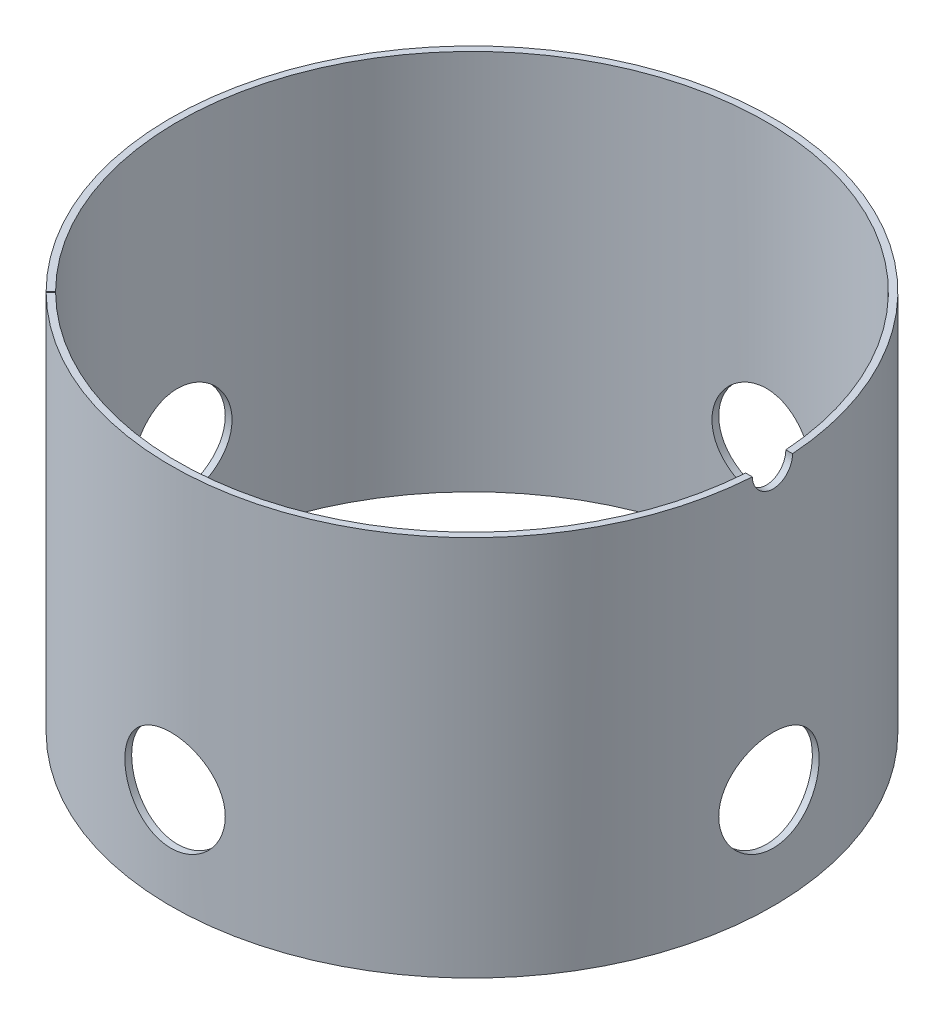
from build123d import *

# Parameters (mm, degrees)
ESQUISSE1_W              = 5
ESQUISSE1_H              = 285
ESQUISSE9_R              = 37.5
ENL_V_MAT_EXTRU_7_DEPTH  = 811.848321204
ENL_V_MAT_EXTRU_9_REACH  = 812.848
ESQUISSE10_R             = 15
ESQUISSE12_R             = 37.5
ENL_V_MAT_EXTRU_11_DEPTH = 811.848321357
ENL_V_MAT_EXTRU_12_DEPTH = 428.170926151


with BuildPart() as part:
    # Esquisse1 → Base-R_vol.-Mince (revolve)
    with BuildSketch(Plane.XY):
        with Locations((222.5, 142.5)):
            Rectangle(ESQUISSE1_W, ESQUISSE1_H)
    revolve(axis=Axis((0, 0, 0), (0, 1, 0)))

    # Esquisse9 → Enl_v. mat.-Extru.7 (cut, through all)
    with BuildSketch(Plane(origin=(500, 0, 0), x_dir=(0, 0, -1), z_dir=(1, 0, 0))):
        with Locations((0, 75)):
            Circle(ESQUISSE9_R)
    extrude(amount=-ENL_V_MAT_EXTRU_7_DEPTH, mode=Mode.SUBTRACT)

    # Esquisse10 → Enl_v. mat.-Extru.9 (cut, up to next)
    with BuildSketch(Plane(origin=(500, 0, 0), x_dir=(0, 0, -1), z_dir=(1, 0, 0)), mode=Mode.PRIVATE) as enl_v_mat_extru_9_sk1:
        with Locations((0, 285)):
            Circle(ESQUISSE10_R)
    enl_v_mat_extru_9_tool1 = extrude(enl_v_mat_extru_9_sk1.sketch, amount=-ENL_V_MAT_EXTRU_9_REACH, mode=Mode.PRIVATE) & part.part
    add(enl_v_mat_extru_9_tool1.solids().sort_by_distance((500, 285, 0))[0], mode=Mode.SUBTRACT)

    # Esquisse12 → Enl_v. mat.-Extru.11 (cut, through all)
    with BuildSketch(Plane.XY.offset(500)):
        with Locations((0, 75)):
            Circle(ESQUISSE12_R)
    extrude(amount=-ENL_V_MAT_EXTRU_11_DEPTH, mode=Mode.SUBTRACT)

    # Esquisse13 → Enl_v. mat.-Extru.12 (cut, through all)
    with BuildSketch(Plane(origin=(0, 285, 0), x_dir=(1, 0, 0), z_dir=(0, 1, 0))):
        Polygon((-136.73836855, -136.031261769), (-198.862035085, -198.154928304), (-198.154928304, -198.862035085), (-136.031261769, -136.73836855), align=None)
    extrude(amount=-ENL_V_MAT_EXTRU_12_DEPTH, mode=Mode.SUBTRACT)


solid = part.part
